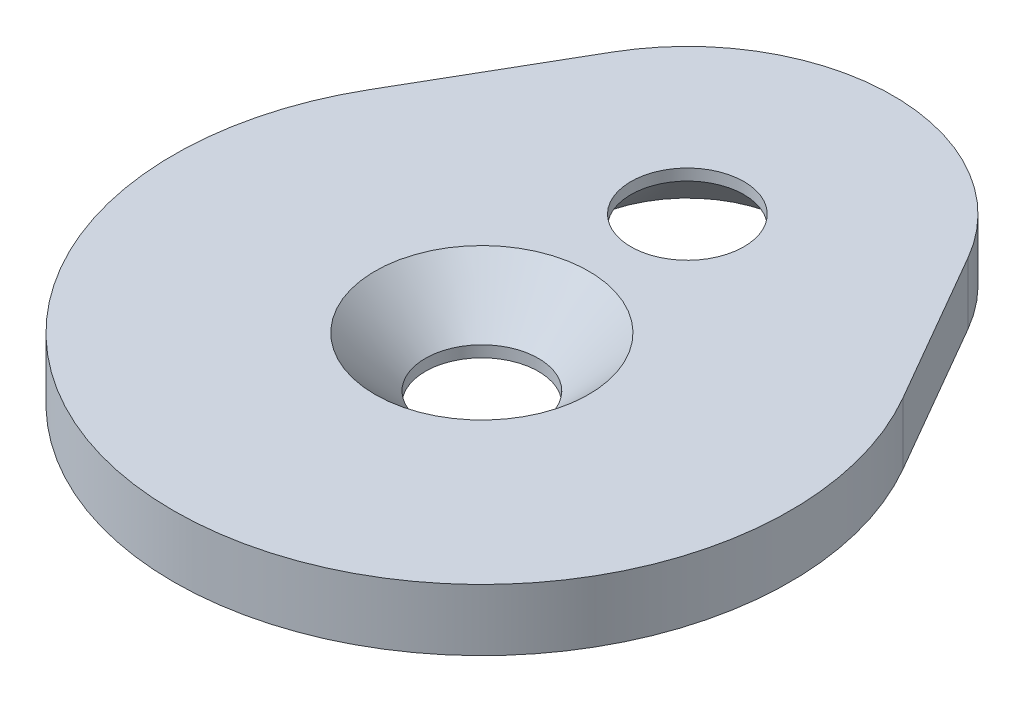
from build123d import *

# Parameters (mm, degrees)
SKETCH1_R      = 2.5
EXTRUDE1_DEPTH = 3


with BuildPart() as part:
    # Sketch1 → Extrude1 (new body)
    with BuildSketch(Plane(origin=(0, 0, 0), x_dir=(1, 0, 0), z_dir=(0, 1, 0))):
        with BuildLine():
            Line((-8.660254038, 15), (-12.990381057, 7.5))
            ThreePointArc((-12.990381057, 7.5), (0, -15), (12.990381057, 7.5))
            Line((12.990381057, 7.5), (8.660254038, 15))
            ThreePointArc((8.660254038, 15), (0, 20), (-8.660254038, 15))
        make_face()
        with Locations(Location((0, 10, 0), (0, 0, 270))):
            Circle(SKETCH1_R, mode=Mode.SUBTRACT)
        with Locations(Location((0, 0, 0), (0, 0, 270))):
            Circle(SKETCH1_R, mode=Mode.SUBTRACT)
    extrude(amount=EXTRUDE1_DEPTH)

    # Sketch5 → CSK for M5 Countersunk Flat Head Screw1 (revolve, cut)
    with BuildSketch(Plane(origin=(0, 3, 0), x_dir=(0, 0, 1), z_dir=(1, 0, 0))):
        Polygon((0, 0), (0, 3), (2.75, 3), (2.75, 2.45), (5.2, 0), align=None)
    revolve(axis=Axis((0, 9.35, 0), (0, -1, 0)), mode=Mode.SUBTRACT)

    # Sketch7 → CSK for M5 Countersunk Flat Head Screw2 (revolve, cut)
    with BuildSketch(Plane(origin=(0, 0, -10), x_dir=(0, 0, -1), z_dir=(1, 0, 0))):
        Polygon((0, 0), (0, 3), (2.75, 3), (2.75, 2.45), (5.2, 0), align=None)
    revolve(axis=Axis((0, -6.35, -10), (0, 1, 0)), mode=Mode.SUBTRACT)


solid = part.part
